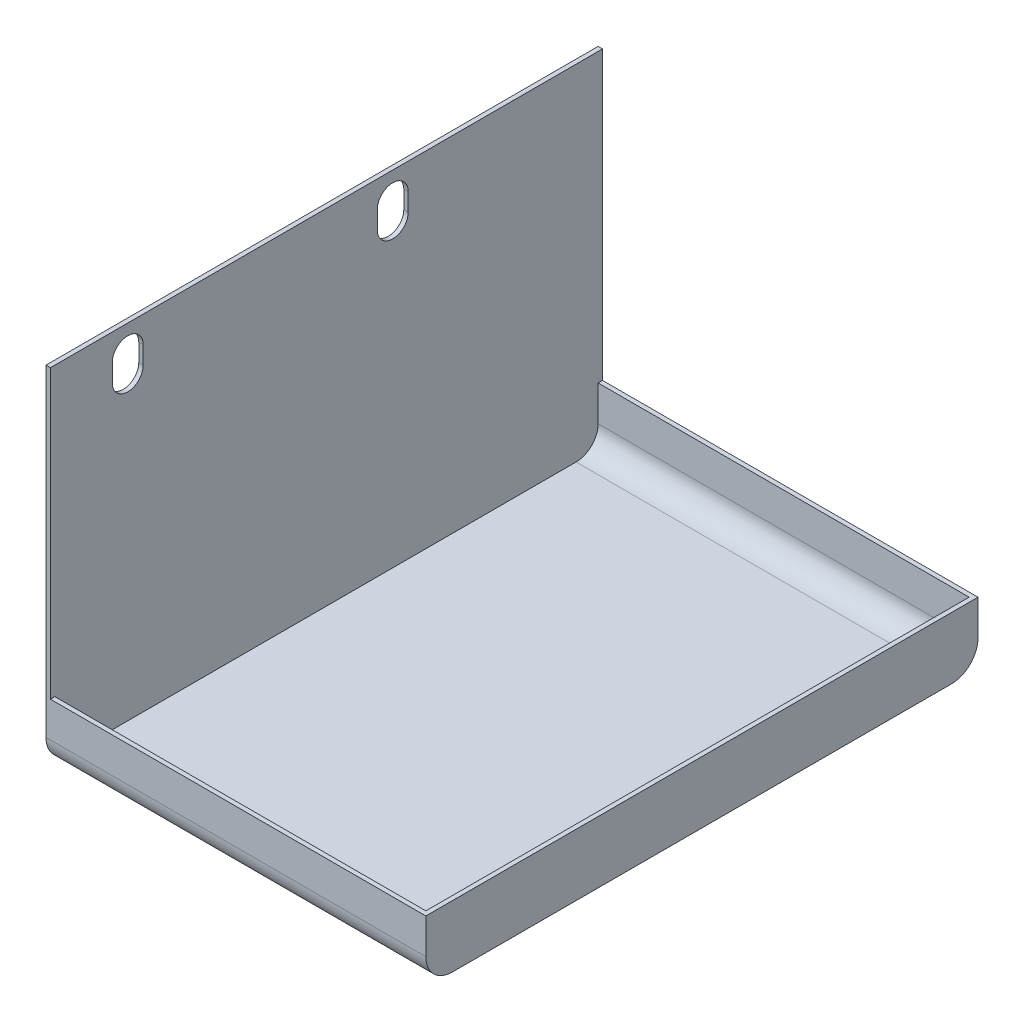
ISO-10303-21;
HEADER;
FILE_DESCRIPTION(('STEP AP214'),'2;1');
FILE_NAME('part.step','',(''),(''),'','','');
FILE_SCHEMA(('AUTOMOTIVE_DESIGN { 1 0 10303 214 1 1 1 1 }'));
ENDSEC;
DATA;
#1=APPLICATION_CONTEXT('core data for automotive mechanical design processes');
#2=APPLICATION_PROTOCOL_DEFINITION('international standard','automotive_design',2000,#1);
#3=PRODUCT_CONTEXT('',#1,'mechanical');
#4=PRODUCT('Part','Part','',(#3));
#5=PRODUCT_RELATED_PRODUCT_CATEGORY('part','',(#4));
#6=PRODUCT_DEFINITION_FORMATION('','',#4);
#7=PRODUCT_DEFINITION_CONTEXT('part definition',#1,'design');
#8=PRODUCT_DEFINITION('design','',#6,#7);
#9=PRODUCT_DEFINITION_SHAPE('','',#8);
#10=(LENGTH_UNIT() NAMED_UNIT(*) SI_UNIT(.MILLI.,.METRE.));
#11=(NAMED_UNIT(*) PLANE_ANGLE_UNIT() SI_UNIT($,.RADIAN.));
#12=(NAMED_UNIT(*) SI_UNIT($,.STERADIAN.) SOLID_ANGLE_UNIT());
#13=UNCERTAINTY_MEASURE_WITH_UNIT(LENGTH_MEASURE(1.E-05),#10,'distance_accuracy_value','');
#14=(GEOMETRIC_REPRESENTATION_CONTEXT(3) GLOBAL_UNCERTAINTY_ASSIGNED_CONTEXT((#13)) GLOBAL_UNIT_ASSIGNED_CONTEXT((#10,
#11,#12)) REPRESENTATION_CONTEXT('',''));
#15=CARTESIAN_POINT('',(0.,0.,0.));
#16=DIRECTION('',(0.,0.,1.));
#17=DIRECTION('',(1.,0.,0.));
#18=AXIS2_PLACEMENT_3D('',#15,#16,#17);
#19=CARTESIAN_POINT('',(0.,13.9999999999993,62.5));
#20=DIRECTION('',(0.,-1.,0.));
#21=DIRECTION('',(0.,0.,-1.));
#22=AXIS2_PLACEMENT_3D('',#19,#20,#21);
#23=PLANE('',#22);
#24=DIRECTION('',(0.,0.,-1.));
#25=VECTOR('',#24,1.);
#26=CARTESIAN_POINT('',(1.,13.9999999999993,62.5));
#27=LINE('',#26,#25);
#28=CARTESIAN_POINT('',(1.,13.9999999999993,62.5));
#29=VERTEX_POINT('',#28);
#30=CARTESIAN_POINT('',(1.00000000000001,14.,61.5));
#31=VERTEX_POINT('',#30);
#32=EDGE_CURVE('E236',#29,#31,#27,.T.);
#33=ORIENTED_EDGE('',*,*,#32,.F.);
#34=DIRECTION('',(-1.,0.,0.));
#35=VECTOR('',#34,1.);
#36=CARTESIAN_POINT('',(0.,13.9999999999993,62.5));
#37=LINE('',#36,#35);
#38=CARTESIAN_POINT('',(86.,14.,62.5));
#39=VERTEX_POINT('',#38);
#40=EDGE_CURVE('E299',#39,#29,#37,.T.);
#41=ORIENTED_EDGE('',*,*,#40,.F.);
#42=DIRECTION('',(0.,0.,-1.));
#43=VECTOR('',#42,1.);
#44=CARTESIAN_POINT('',(86.,14.,62.5));
#45=LINE('',#44,#43);
#46=CARTESIAN_POINT('',(86.,14.,-62.5));
#47=VERTEX_POINT('',#46);
#48=EDGE_CURVE('E302',#39,#47,#45,.T.);
#49=ORIENTED_EDGE('',*,*,#48,.T.);
#50=DIRECTION('',(-1.,0.,0.));
#51=VECTOR('',#50,1.);
#52=CARTESIAN_POINT('',(0.,14.,-62.5));
#53=LINE('',#52,#51);
#54=CARTESIAN_POINT('',(0.999999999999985,14.,-62.5));
#55=VERTEX_POINT('',#54);
#56=EDGE_CURVE('E291',#47,#55,#53,.T.);
#57=ORIENTED_EDGE('',*,*,#56,.T.);
#58=CARTESIAN_POINT('',(1.00000000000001,14.,-61.5));
#59=VERTEX_POINT('',#58);
#60=EDGE_CURVE('E11',#59,#55,#27,.T.);
#61=ORIENTED_EDGE('',*,*,#60,.F.);
#62=DIRECTION('',(-1.,0.,0.));
#63=VECTOR('',#62,1.);
#64=CARTESIAN_POINT('',(0.,14.,-61.5));
#65=LINE('',#64,#63);
#66=CARTESIAN_POINT('',(85.0000000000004,14.,-61.5));
#67=VERTEX_POINT('',#66);
#68=EDGE_CURVE('E273',#67,#59,#65,.T.);
#69=ORIENTED_EDGE('',*,*,#68,.F.);
#70=DIRECTION('',(0.,0.,-1.));
#71=VECTOR('',#70,1.);
#72=CARTESIAN_POINT('',(85.,14.,62.5));
#73=LINE('',#72,#71);
#74=CARTESIAN_POINT('',(85.,14.,61.5));
#75=VERTEX_POINT('',#74);
#76=EDGE_CURVE('E267',#75,#67,#73,.T.);
#77=ORIENTED_EDGE('',*,*,#76,.F.);
#78=DIRECTION('',(-1.,0.,0.));
#79=VECTOR('',#78,1.);
#80=CARTESIAN_POINT('',(0.,14.,61.5));
#81=LINE('',#80,#79);
#82=EDGE_CURVE('E278',#75,#31,#81,.T.);
#83=ORIENTED_EDGE('',*,*,#82,.T.);
#84=EDGE_LOOP('',(#33,#41,#49,#57,#61,#69,#77,#83));
#85=FACE_BOUND('',#84,.T.);
#86=ADVANCED_FACE('F16',(#85),#23,.F.);
#87=CARTESIAN_POINT('',(0.,-6.93889390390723E-13,62.5));
#88=DIRECTION('',(1.,0.,0.));
#89=DIRECTION('',(0.,0.,-1.));
#90=AXIS2_PLACEMENT_3D('',#87,#88,#89);
#91=PLANE('',#90);
#92=DIRECTION('',(0.,1.,0.));
#93=VECTOR('',#92,1.);
#94=CARTESIAN_POINT('',(0.,0.,41.5));
#95=LINE('',#94,#93);
#96=CARTESIAN_POINT('',(0.,69.,41.5));
#97=VERTEX_POINT('',#96);
#98=CARTESIAN_POINT('',(0.,73.,41.5));
#99=VERTEX_POINT('',#98);
#100=EDGE_CURVE('E198',#97,#99,#95,.T.);
#101=ORIENTED_EDGE('',*,*,#100,.T.);
#102=CARTESIAN_POINT('',(0.,73.,45.));
#103=DIRECTION('',(1.,0.,0.));
#104=DIRECTION('',(0.,0.,-1.));
#105=AXIS2_PLACEMENT_3D('',#102,#103,#104);
#106=CIRCLE('',#105,3.5);
#107=CARTESIAN_POINT('',(0.,73.,48.5));
#108=VERTEX_POINT('',#107);
#109=EDGE_CURVE('E201',#99,#108,#106,.T.);
#110=ORIENTED_EDGE('',*,*,#109,.T.);
#111=DIRECTION('',(0.,-1.,0.));
#112=VECTOR('',#111,1.);
#113=CARTESIAN_POINT('',(0.,0.,48.5));
#114=LINE('',#113,#112);
#115=CARTESIAN_POINT('',(0.,69.,48.5));
#116=VERTEX_POINT('',#115);
#117=EDGE_CURVE('E193',#108,#116,#114,.T.);
#118=ORIENTED_EDGE('',*,*,#117,.T.);
#119=CARTESIAN_POINT('',(0.,69.,45.));
#120=DIRECTION('',(1.,0.,0.));
#121=DIRECTION('',(0.,0.,-1.));
#122=AXIS2_PLACEMENT_3D('',#119,#120,#121);
#123=CIRCLE('',#122,3.5);
#124=EDGE_CURVE('E173',#116,#97,#123,.T.);
#125=ORIENTED_EDGE('',*,*,#124,.T.);
#126=EDGE_LOOP('',(#101,#110,#118,#125));
#127=FACE_BOUND('',#126,.T.);
#128=DIRECTION('',(0.,1.,0.));
#129=VECTOR('',#128,1.);
#130=CARTESIAN_POINT('',(0.,0.,-18.5));
#131=LINE('',#130,#129);
#132=CARTESIAN_POINT('',(0.,69.,-18.5));
#133=VERTEX_POINT('',#132);
#134=CARTESIAN_POINT('',(0.,73.,-18.5));
#135=VERTEX_POINT('',#134);
#136=EDGE_CURVE('E230',#133,#135,#131,.T.);
#137=ORIENTED_EDGE('',*,*,#136,.T.);
#138=CARTESIAN_POINT('',(0.,73.,-15.));
#139=DIRECTION('',(1.,0.,0.));
#140=DIRECTION('',(0.,0.,-1.));
#141=AXIS2_PLACEMENT_3D('',#138,#139,#140);
#142=CIRCLE('',#141,3.5);
#143=CARTESIAN_POINT('',(0.,73.,-11.5));
#144=VERTEX_POINT('',#143);
#145=EDGE_CURVE('E233',#135,#144,#142,.T.);
#146=ORIENTED_EDGE('',*,*,#145,.T.);
#147=DIRECTION('',(0.,-1.,0.));
#148=VECTOR('',#147,1.);
#149=CARTESIAN_POINT('',(0.,0.,-11.5));
#150=LINE('',#149,#148);
#151=CARTESIAN_POINT('',(0.,69.,-11.5));
#152=VERTEX_POINT('',#151);
#153=EDGE_CURVE('E218',#144,#152,#150,.T.);
#154=ORIENTED_EDGE('',*,*,#153,.T.);
#155=CARTESIAN_POINT('',(0.,69.,-15.));
#156=DIRECTION('',(1.,0.,0.));
#157=DIRECTION('',(0.,0.,-1.));
#158=AXIS2_PLACEMENT_3D('',#155,#156,#157);
#159=CIRCLE('',#158,3.5);
#160=EDGE_CURVE('E227',#152,#133,#159,.T.);
#161=ORIENTED_EDGE('',*,*,#160,.T.);
#162=EDGE_LOOP('',(#137,#146,#154,#161));
#163=FACE_BOUND('',#162,.T.);
#164=DIRECTION('',(0.,-1.,0.));
#165=VECTOR('',#164,1.);
#166=CARTESIAN_POINT('',(0.,0.,-62.5000000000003));
#167=LINE('',#166,#165);
#168=CARTESIAN_POINT('',(0.,78.9999999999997,-62.5));
#169=VERTEX_POINT('',#168);
#170=CARTESIAN_POINT('',(0.,6.00000000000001,-62.5));
#171=VERTEX_POINT('',#170);
#172=EDGE_CURVE('E283',#169,#171,#167,.T.);
#173=ORIENTED_EDGE('',*,*,#172,.T.);
#174=CARTESIAN_POINT('',(0.,6.00000000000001,-56.5));
#175=DIRECTION('',(1.,0.,0.));
#176=DIRECTION('',(0.,0.,-1.));
#177=AXIS2_PLACEMENT_3D('',#174,#175,#176);
#178=CIRCLE('',#177,6.);
#179=CARTESIAN_POINT('',(0.,0.,-56.5000000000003));
#180=VERTEX_POINT('',#179);
#181=EDGE_CURVE('E326',#171,#180,#178,.F.);
#182=ORIENTED_EDGE('',*,*,#181,.T.);
#183=DIRECTION('',(0.,0.,-1.));
#184=VECTOR('',#183,1.);
#185=CARTESIAN_POINT('',(0.,-6.93889390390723E-13,62.5));
#186=LINE('',#185,#184);
#187=CARTESIAN_POINT('',(0.,-6.93889390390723E-13,56.5));
#188=VERTEX_POINT('',#187);
#189=EDGE_CURVE('E311',#188,#180,#186,.T.);
#190=ORIENTED_EDGE('',*,*,#189,.F.);
#191=CARTESIAN_POINT('',(0.,5.99999999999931,56.5));
#192=DIRECTION('',(1.,0.,0.));
#193=DIRECTION('',(0.,0.,-1.));
#194=AXIS2_PLACEMENT_3D('',#191,#192,#193);
#195=CIRCLE('',#194,6.);
#196=CARTESIAN_POINT('',(0.,5.99999999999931,62.5));
#197=VERTEX_POINT('',#196);
#198=EDGE_CURVE('E325',#188,#197,#195,.F.);
#199=ORIENTED_EDGE('',*,*,#198,.T.);
#200=DIRECTION('',(0.,-1.,0.));
#201=VECTOR('',#200,1.);
#202=CARTESIAN_POINT('',(0.,-6.93889390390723E-13,62.5));
#203=LINE('',#202,#201);
#204=CARTESIAN_POINT('',(0.,79.,62.5));
#205=VERTEX_POINT('',#204);
#206=EDGE_CURVE('E294',#205,#197,#203,.T.);
#207=ORIENTED_EDGE('',*,*,#206,.F.);
#208=DIRECTION('',(0.,0.,1.));
#209=VECTOR('',#208,1.);
#210=CARTESIAN_POINT('',(0.,79.,62.5));
#211=LINE('',#210,#209);
#212=EDGE_CURVE('E359',#169,#205,#211,.T.);
#213=ORIENTED_EDGE('',*,*,#212,.F.);
#214=EDGE_LOOP('',(#173,#182,#190,#199,#207,#213));
#215=FACE_BOUND('',#214,.T.);
#216=ADVANCED_FACE('F18',(#127,#163,#215),#91,.F.);
#217=CARTESIAN_POINT('',(0.,-6.93889390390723E-13,62.5));
#218=DIRECTION('',(0.,1.,0.));
#219=DIRECTION('',(0.,0.,1.));
#220=AXIS2_PLACEMENT_3D('',#217,#218,#219);
#221=PLANE('',#220);
#222=ORIENTED_EDGE('',*,*,#189,.T.);
#223=DIRECTION('',(1.,0.,0.));
#224=VECTOR('',#223,1.);
#225=CARTESIAN_POINT('',(86.0000000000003,0.,-56.5000000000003));
#226=LINE('',#225,#224);
#227=CARTESIAN_POINT('',(86.0000000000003,0.,-56.5000000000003));
#228=VERTEX_POINT('',#227);
#229=EDGE_CURVE('E316',#180,#228,#226,.T.);
#230=ORIENTED_EDGE('',*,*,#229,.T.);
#231=DIRECTION('',(0.,0.,-1.));
#232=VECTOR('',#231,1.);
#233=CARTESIAN_POINT('',(86.,0.,62.5));
#234=LINE('',#233,#232);
#235=CARTESIAN_POINT('',(86.,0.,56.5));
#236=VERTEX_POINT('',#235);
#237=EDGE_CURVE('E308',#236,#228,#234,.T.);
#238=ORIENTED_EDGE('',*,*,#237,.F.);
#239=DIRECTION('',(1.,0.,0.));
#240=VECTOR('',#239,1.);
#241=CARTESIAN_POINT('',(0.,-6.93889390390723E-13,56.5));
#242=LINE('',#241,#240);
#243=EDGE_CURVE('E314',#236,#188,#242,.F.);
#244=ORIENTED_EDGE('',*,*,#243,.T.);
#245=EDGE_LOOP('',(#222,#230,#238,#244));
#246=FACE_BOUND('',#245,.T.);
#247=ADVANCED_FACE('F415',(#246),#221,.F.);
#248=CARTESIAN_POINT('',(86.,0.,62.5));
#249=DIRECTION('',(-1.,0.,0.));
#250=DIRECTION('',(0.,0.,1.));
#251=AXIS2_PLACEMENT_3D('',#248,#249,#250);
#252=PLANE('',#251);
#253=ORIENTED_EDGE('',*,*,#237,.T.);
#254=CARTESIAN_POINT('',(86.0000000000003,6.00000000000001,-56.5));
#255=DIRECTION('',(-1.,0.,0.));
#256=DIRECTION('',(0.,0.,1.));
#257=AXIS2_PLACEMENT_3D('',#254,#255,#256);
#258=CIRCLE('',#257,6.);
#259=CARTESIAN_POINT('',(86.0000000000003,6.00000000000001,-62.5));
#260=VERTEX_POINT('',#259);
#261=EDGE_CURVE('E321',#228,#260,#258,.F.);
#262=ORIENTED_EDGE('',*,*,#261,.T.);
#263=DIRECTION('',(0.,1.,0.));
#264=VECTOR('',#263,1.);
#265=CARTESIAN_POINT('',(86.0000000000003,0.,-62.5000000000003));
#266=LINE('',#265,#264);
#267=EDGE_CURVE('E289',#260,#47,#266,.T.);
#268=ORIENTED_EDGE('',*,*,#267,.T.);
#269=ORIENTED_EDGE('',*,*,#48,.F.);
#270=DIRECTION('',(0.,1.,0.));
#271=VECTOR('',#270,1.);
#272=CARTESIAN_POINT('',(86.,0.,62.5));
#273=LINE('',#272,#271);
#274=CARTESIAN_POINT('',(86.,5.99999999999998,62.5));
#275=VERTEX_POINT('',#274);
#276=EDGE_CURVE('E303',#275,#39,#273,.T.);
#277=ORIENTED_EDGE('',*,*,#276,.F.);
#278=CARTESIAN_POINT('',(86.,5.99999999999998,56.5));
#279=DIRECTION('',(-1.,0.,0.));
#280=DIRECTION('',(0.,0.,1.));
#281=AXIS2_PLACEMENT_3D('',#278,#279,#280);
#282=CIRCLE('',#281,6.);
#283=EDGE_CURVE('E319',#275,#236,#282,.F.);
#284=ORIENTED_EDGE('',*,*,#283,.T.);
#285=EDGE_LOOP('',(#253,#262,#268,#269,#277,#284));
#286=FACE_BOUND('',#285,.T.);
#287=ADVANCED_FACE('F341',(#286),#252,.F.);
#288=CARTESIAN_POINT('',(0.,13.9999999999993,62.5));
#289=DIRECTION('',(0.,0.,-1.));
#290=DIRECTION('',(-1.,0.,0.));
#291=AXIS2_PLACEMENT_3D('',#288,#289,#290);
#292=PLANE('',#291);
#293=ORIENTED_EDGE('',*,*,#206,.T.);
#294=DIRECTION('',(1.,0.,0.));
#295=VECTOR('',#294,1.);
#296=CARTESIAN_POINT('',(0.,5.99999999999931,62.5));
#297=LINE('',#296,#295);
#298=EDGE_CURVE('E25',#197,#275,#297,.T.);
#299=ORIENTED_EDGE('',*,*,#298,.T.);
#300=ORIENTED_EDGE('',*,*,#276,.T.);
#301=ORIENTED_EDGE('',*,*,#40,.T.);
#302=DIRECTION('',(0.,-1.,0.));
#303=VECTOR('',#302,1.);
#304=CARTESIAN_POINT('',(1.,79.,62.5000000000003));
#305=LINE('',#304,#303);
#306=CARTESIAN_POINT('',(1.,79.,62.5000000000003));
#307=VERTEX_POINT('',#306);
#308=EDGE_CURVE('E350',#307,#29,#305,.T.);
#309=ORIENTED_EDGE('',*,*,#308,.F.);
#310=DIRECTION('',(1.,0.,0.));
#311=VECTOR('',#310,1.);
#312=CARTESIAN_POINT('',(1.,79.,62.5000000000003));
#313=LINE('',#312,#311);
#314=EDGE_CURVE('E248',#205,#307,#313,.T.);
#315=ORIENTED_EDGE('',*,*,#314,.F.);
#316=EDGE_LOOP('',(#293,#299,#300,#301,#309,#315));
#317=FACE_BOUND('',#316,.T.);
#318=ADVANCED_FACE('F335',(#317),#292,.F.);
#319=CARTESIAN_POINT('',(0.,14.,-62.5));
#320=DIRECTION('',(0.,0.,-1.));
#321=DIRECTION('',(-1.,0.,0.));
#322=AXIS2_PLACEMENT_3D('',#319,#320,#321);
#323=PLANE('',#322);
#324=ORIENTED_EDGE('',*,*,#267,.F.);
#325=DIRECTION('',(1.,0.,0.));
#326=VECTOR('',#325,1.);
#327=CARTESIAN_POINT('',(0.,6.00000000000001,-62.5));
#328=LINE('',#327,#326);
#329=EDGE_CURVE('E323',#260,#171,#328,.F.);
#330=ORIENTED_EDGE('',*,*,#329,.T.);
#331=ORIENTED_EDGE('',*,*,#172,.F.);
#332=DIRECTION('',(-1.,0.,0.));
#333=VECTOR('',#332,1.);
#334=CARTESIAN_POINT('',(0.999999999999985,78.9999999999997,-62.5000000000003));
#335=LINE('',#334,#333);
#336=CARTESIAN_POINT('',(0.999999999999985,78.9999999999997,-62.5000000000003));
#337=VERTEX_POINT('',#336);
#338=EDGE_CURVE('E433',#337,#169,#335,.T.);
#339=ORIENTED_EDGE('',*,*,#338,.F.);
#340=DIRECTION('',(0.,-1.,0.));
#341=VECTOR('',#340,1.);
#342=CARTESIAN_POINT('',(0.999999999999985,78.9999999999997,-62.5000000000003));
#343=LINE('',#342,#341);
#344=EDGE_CURVE('E357',#337,#55,#343,.T.);
#345=ORIENTED_EDGE('',*,*,#344,.T.);
#346=ORIENTED_EDGE('',*,*,#56,.F.);
#347=EDGE_LOOP('',(#324,#330,#331,#339,#345,#346));
#348=FACE_BOUND('',#347,.T.);
#349=ADVANCED_FACE('F431',(#348),#323,.T.);
#350=CARTESIAN_POINT('',(0.,6.00000000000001,-56.5));
#351=DIRECTION('',(-1.,0.,0.));
#352=DIRECTION('',(0.,0.,1.));
#353=AXIS2_PLACEMENT_3D('',#350,#351,#352);
#354=CYLINDRICAL_SURFACE('',#353,6.);
#355=ORIENTED_EDGE('',*,*,#181,.F.);
#356=ORIENTED_EDGE('',*,*,#329,.F.);
#357=ORIENTED_EDGE('',*,*,#261,.F.);
#358=ORIENTED_EDGE('',*,*,#229,.F.);
#359=EDGE_LOOP('',(#355,#356,#357,#358));
#360=FACE_BOUND('',#359,.T.);
#361=ADVANCED_FACE('F428',(#360),#354,.T.);
#362=CARTESIAN_POINT('',(0.,5.99999999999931,56.5));
#363=DIRECTION('',(1.,0.,0.));
#364=DIRECTION('',(0.,0.,-1.));
#365=AXIS2_PLACEMENT_3D('',#362,#363,#364);
#366=CYLINDRICAL_SURFACE('',#365,6.);
#367=ORIENTED_EDGE('',*,*,#198,.F.);
#368=ORIENTED_EDGE('',*,*,#243,.F.);
#369=ORIENTED_EDGE('',*,*,#283,.F.);
#370=ORIENTED_EDGE('',*,*,#298,.F.);
#371=EDGE_LOOP('',(#367,#368,#369,#370));
#372=FACE_BOUND('',#371,.T.);
#373=ADVANCED_FACE('F408',(#372),#366,.T.);
#374=CARTESIAN_POINT('',(1.00000000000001,-6.93889390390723E-13,62.5));
#375=DIRECTION('',(1.,0.,0.));
#376=DIRECTION('',(0.,0.,-1.));
#377=AXIS2_PLACEMENT_3D('',#374,#375,#376);
#378=PLANE('',#377);
#379=CARTESIAN_POINT('',(1.00000000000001,73.,44.9999999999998));
#380=DIRECTION('',(1.,0.,0.));
#381=DIRECTION('',(0.,0.,-1.));
#382=AXIS2_PLACEMENT_3D('',#379,#380,#381);
#383=CIRCLE('',#382,3.5);
#384=CARTESIAN_POINT('',(1.00000000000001,73.,41.4999999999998));
#385=VERTEX_POINT('',#384);
#386=CARTESIAN_POINT('',(1.,73.,48.4999999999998));
#387=VERTEX_POINT('',#386);
#388=EDGE_CURVE('E41',#385,#387,#383,.T.);
#389=ORIENTED_EDGE('',*,*,#388,.F.);
#390=DIRECTION('',(0.,1.,0.));
#391=VECTOR('',#390,1.);
#392=CARTESIAN_POINT('',(1.00000000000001,73.,41.4999999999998));
#393=LINE('',#392,#391);
#394=CARTESIAN_POINT('',(1.00000000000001,69.,41.5));
#395=VERTEX_POINT('',#394);
#396=EDGE_CURVE('E186',#395,#385,#393,.T.);
#397=ORIENTED_EDGE('',*,*,#396,.F.);
#398=CARTESIAN_POINT('',(1.,69.,45.));
#399=DIRECTION('',(1.,0.,0.));
#400=DIRECTION('',(0.,0.,-1.));
#401=AXIS2_PLACEMENT_3D('',#398,#399,#400);
#402=CIRCLE('',#401,3.5);
#403=CARTESIAN_POINT('',(1.,69.,48.5));
#404=VERTEX_POINT('',#403);
#405=EDGE_CURVE('E170',#404,#395,#402,.T.);
#406=ORIENTED_EDGE('',*,*,#405,.F.);
#407=DIRECTION('',(0.,-1.,0.));
#408=VECTOR('',#407,1.);
#409=CARTESIAN_POINT('',(1.,73.,48.4999999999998));
#410=LINE('',#409,#408);
#411=EDGE_CURVE('E179',#387,#404,#410,.T.);
#412=ORIENTED_EDGE('',*,*,#411,.F.);
#413=EDGE_LOOP('',(#389,#397,#406,#412));
#414=FACE_BOUND('',#413,.T.);
#415=CARTESIAN_POINT('',(1.,73.,-14.9999999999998));
#416=DIRECTION('',(1.,0.,0.));
#417=DIRECTION('',(0.,0.,-1.));
#418=AXIS2_PLACEMENT_3D('',#415,#416,#417);
#419=CIRCLE('',#418,3.5);
#420=CARTESIAN_POINT('',(1.00000000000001,73.,-18.4999999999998));
#421=VERTEX_POINT('',#420);
#422=CARTESIAN_POINT('',(1.00000000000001,73.,-11.4999999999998));
#423=VERTEX_POINT('',#422);
#424=EDGE_CURVE('E204',#421,#423,#419,.T.);
#425=ORIENTED_EDGE('',*,*,#424,.F.);
#426=DIRECTION('',(0.,1.,0.));
#427=VECTOR('',#426,1.);
#428=CARTESIAN_POINT('',(1.00000000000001,73.,-18.4999999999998));
#429=LINE('',#428,#427);
#430=CARTESIAN_POINT('',(1.,69.,-18.5));
#431=VERTEX_POINT('',#430);
#432=EDGE_CURVE('E212',#431,#421,#429,.T.);
#433=ORIENTED_EDGE('',*,*,#432,.F.);
#434=CARTESIAN_POINT('',(1.,69.,-15.));
#435=DIRECTION('',(1.,0.,0.));
#436=DIRECTION('',(0.,0.,-1.));
#437=AXIS2_PLACEMENT_3D('',#434,#435,#436);
#438=CIRCLE('',#437,3.5);
#439=CARTESIAN_POINT('',(1.00000000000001,69.,-11.5));
#440=VERTEX_POINT('',#439);
#441=EDGE_CURVE('E209',#440,#431,#438,.T.);
#442=ORIENTED_EDGE('',*,*,#441,.F.);
#443=DIRECTION('',(0.,-1.,0.));
#444=VECTOR('',#443,1.);
#445=CARTESIAN_POINT('',(1.00000000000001,73.,-11.4999999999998));
#446=LINE('',#445,#444);
#447=EDGE_CURVE('E206',#423,#440,#446,.T.);
#448=ORIENTED_EDGE('',*,*,#447,.F.);
#449=EDGE_LOOP('',(#425,#433,#442,#448));
#450=FACE_BOUND('',#449,.T.);
#451=DIRECTION('',(0.,-1.,0.));
#452=VECTOR('',#451,1.);
#453=CARTESIAN_POINT('',(1.00000000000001,14.,-61.5));
#454=LINE('',#453,#452);
#455=CARTESIAN_POINT('',(1.,6.00000000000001,-61.5));
#456=VERTEX_POINT('',#455);
#457=EDGE_CURVE('E274',#59,#456,#454,.T.);
#458=ORIENTED_EDGE('',*,*,#457,.F.);
#459=ORIENTED_EDGE('',*,*,#60,.T.);
#460=ORIENTED_EDGE('',*,*,#344,.F.);
#461=DIRECTION('',(0.,0.,-1.));
#462=VECTOR('',#461,1.);
#463=CARTESIAN_POINT('',(1.,79.,62.5000000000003));
#464=LINE('',#463,#462);
#465=EDGE_CURVE('E239',#307,#337,#464,.T.);
#466=ORIENTED_EDGE('',*,*,#465,.F.);
#467=ORIENTED_EDGE('',*,*,#308,.T.);
#468=ORIENTED_EDGE('',*,*,#32,.T.);
#469=DIRECTION('',(0.,-1.,0.));
#470=VECTOR('',#469,1.);
#471=CARTESIAN_POINT('',(1.00000000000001,14.,61.5));
#472=LINE('',#471,#470);
#473=CARTESIAN_POINT('',(1.,6.00000000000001,61.5));
#474=VERTEX_POINT('',#473);
#475=EDGE_CURVE('E279',#31,#474,#472,.T.);
#476=ORIENTED_EDGE('',*,*,#475,.T.);
#477=CARTESIAN_POINT('',(1.00000000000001,5.99999999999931,56.5));
#478=DIRECTION('',(1.,0.,0.));
#479=DIRECTION('',(0.,0.,-1.));
#480=AXIS2_PLACEMENT_3D('',#477,#478,#479);
#481=CIRCLE('',#480,5.);
#482=CARTESIAN_POINT('',(1.,0.999999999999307,56.5));
#483=VERTEX_POINT('',#482);
#484=EDGE_CURVE('E253',#483,#474,#481,.F.);
#485=ORIENTED_EDGE('',*,*,#484,.F.);
#486=DIRECTION('',(0.,0.,-1.));
#487=VECTOR('',#486,1.);
#488=CARTESIAN_POINT('',(1.,0.999999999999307,62.5));
#489=LINE('',#488,#487);
#490=CARTESIAN_POINT('',(1.00000000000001,1.,-56.5));
#491=VERTEX_POINT('',#490);
#492=EDGE_CURVE('E254',#483,#491,#489,.T.);
#493=ORIENTED_EDGE('',*,*,#492,.T.);
#494=CARTESIAN_POINT('',(1.00000000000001,6.00000000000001,-56.5));
#495=DIRECTION('',(1.,0.,0.));
#496=DIRECTION('',(0.,0.,-1.));
#497=AXIS2_PLACEMENT_3D('',#494,#495,#496);
#498=CIRCLE('',#497,5.);
#499=EDGE_CURVE('E250',#456,#491,#498,.F.);
#500=ORIENTED_EDGE('',*,*,#499,.F.);
#501=EDGE_LOOP('',(#458,#459,#460,#466,#467,#468,#476,#485,#493,#500));
#502=FACE_BOUND('',#501,.T.);
#503=ADVANCED_FACE('F183',(#414,#450,#502),#378,.T.);
#504=CARTESIAN_POINT('',(0.,0.999999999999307,62.5));
#505=DIRECTION('',(0.,1.,0.));
#506=DIRECTION('',(0.,0.,1.));
#507=AXIS2_PLACEMENT_3D('',#504,#505,#506);
#508=PLANE('',#507);
#509=ORIENTED_EDGE('',*,*,#492,.F.);
#510=DIRECTION('',(1.,0.,0.));
#511=VECTOR('',#510,1.);
#512=CARTESIAN_POINT('',(0.,0.999999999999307,56.5));
#513=LINE('',#512,#511);
#514=CARTESIAN_POINT('',(85.,1.,56.5));
#515=VERTEX_POINT('',#514);
#516=EDGE_CURVE('E257',#515,#483,#513,.F.);
#517=ORIENTED_EDGE('',*,*,#516,.F.);
#518=DIRECTION('',(0.,0.,-1.));
#519=VECTOR('',#518,1.);
#520=CARTESIAN_POINT('',(85.,1.,62.5));
#521=LINE('',#520,#519);
#522=CARTESIAN_POINT('',(85.0000000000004,1.,-56.5));
#523=VERTEX_POINT('',#522);
#524=EDGE_CURVE('E258',#515,#523,#521,.T.);
#525=ORIENTED_EDGE('',*,*,#524,.T.);
#526=DIRECTION('',(1.,0.,0.));
#527=VECTOR('',#526,1.);
#528=CARTESIAN_POINT('',(0.,1.,-56.5));
#529=LINE('',#528,#527);
#530=EDGE_CURVE('E261',#491,#523,#529,.T.);
#531=ORIENTED_EDGE('',*,*,#530,.F.);
#532=EDGE_LOOP('',(#509,#517,#525,#531));
#533=FACE_BOUND('',#532,.T.);
#534=ADVANCED_FACE('F399',(#533),#508,.T.);
#535=CARTESIAN_POINT('',(85.,0.,62.5));
#536=DIRECTION('',(-1.,0.,0.));
#537=DIRECTION('',(0.,0.,1.));
#538=AXIS2_PLACEMENT_3D('',#535,#536,#537);
#539=PLANE('',#538);
#540=ORIENTED_EDGE('',*,*,#524,.F.);
#541=CARTESIAN_POINT('',(85.,5.99999999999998,56.5));
#542=DIRECTION('',(-1.,0.,0.));
#543=DIRECTION('',(0.,0.,1.));
#544=AXIS2_PLACEMENT_3D('',#541,#542,#543);
#545=CIRCLE('',#544,5.);
#546=CARTESIAN_POINT('',(85.,6.00000000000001,61.5));
#547=VERTEX_POINT('',#546);
#548=EDGE_CURVE('E264',#547,#515,#545,.F.);
#549=ORIENTED_EDGE('',*,*,#548,.F.);
#550=DIRECTION('',(0.,1.,0.));
#551=VECTOR('',#550,1.);
#552=CARTESIAN_POINT('',(85.,14.,61.5));
#553=LINE('',#552,#551);
#554=EDGE_CURVE('E275',#547,#75,#553,.T.);
#555=ORIENTED_EDGE('',*,*,#554,.T.);
#556=ORIENTED_EDGE('',*,*,#76,.T.);
#557=DIRECTION('',(0.,1.,0.));
#558=VECTOR('',#557,1.);
#559=CARTESIAN_POINT('',(85.0000000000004,14.,-61.5));
#560=LINE('',#559,#558);
#561=CARTESIAN_POINT('',(85.,6.00000000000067,-61.5));
#562=VERTEX_POINT('',#561);
#563=EDGE_CURVE('E271',#562,#67,#560,.T.);
#564=ORIENTED_EDGE('',*,*,#563,.F.);
#565=CARTESIAN_POINT('',(85.0000000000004,6.00000000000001,-56.5));
#566=DIRECTION('',(-1.,0.,0.));
#567=DIRECTION('',(0.,0.,1.));
#568=AXIS2_PLACEMENT_3D('',#565,#566,#567);
#569=CIRCLE('',#568,5.);
#570=EDGE_CURVE('E269',#523,#562,#569,.F.);
#571=ORIENTED_EDGE('',*,*,#570,.F.);
#572=EDGE_LOOP('',(#540,#549,#555,#556,#564,#571));
#573=FACE_BOUND('',#572,.T.);
#574=ADVANCED_FACE('F390',(#573),#539,.T.);
#575=CARTESIAN_POINT('',(0.,14.,61.5));
#576=DIRECTION('',(0.,0.,-1.));
#577=DIRECTION('',(-1.,0.,0.));
#578=AXIS2_PLACEMENT_3D('',#575,#576,#577);
#579=PLANE('',#578);
#580=ORIENTED_EDGE('',*,*,#475,.F.);
#581=ORIENTED_EDGE('',*,*,#82,.F.);
#582=ORIENTED_EDGE('',*,*,#554,.F.);
#583=DIRECTION('',(-1.,0.,0.));
#584=VECTOR('',#583,1.);
#585=CARTESIAN_POINT('',(0.,6.00000000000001,61.5));
#586=LINE('',#585,#584);
#587=EDGE_CURVE('E252',#474,#547,#586,.F.);
#588=ORIENTED_EDGE('',*,*,#587,.F.);
#589=EDGE_LOOP('',(#580,#581,#582,#588));
#590=FACE_BOUND('',#589,.T.);
#591=ADVANCED_FACE('F393',(#590),#579,.T.);
#592=CARTESIAN_POINT('',(0.,14.,-61.5));
#593=DIRECTION('',(0.,0.,-1.));
#594=DIRECTION('',(-1.,0.,0.));
#595=AXIS2_PLACEMENT_3D('',#592,#593,#594);
#596=PLANE('',#595);
#597=ORIENTED_EDGE('',*,*,#563,.T.);
#598=ORIENTED_EDGE('',*,*,#68,.T.);
#599=ORIENTED_EDGE('',*,*,#457,.T.);
#600=DIRECTION('',(-1.,0.,0.));
#601=VECTOR('',#600,1.);
#602=CARTESIAN_POINT('',(0.,6.00000000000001,-61.5));
#603=LINE('',#602,#601);
#604=EDGE_CURVE('E260',#562,#456,#603,.T.);
#605=ORIENTED_EDGE('',*,*,#604,.F.);
#606=EDGE_LOOP('',(#597,#598,#599,#605));
#607=FACE_BOUND('',#606,.T.);
#608=ADVANCED_FACE('F378',(#607),#596,.F.);
#609=CARTESIAN_POINT('',(0.,6.00000000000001,-56.5));
#610=DIRECTION('',(-1.,0.,0.));
#611=DIRECTION('',(0.,0.,1.));
#612=AXIS2_PLACEMENT_3D('',#609,#610,#611);
#613=CYLINDRICAL_SURFACE('',#612,5.);
#614=ORIENTED_EDGE('',*,*,#499,.T.);
#615=ORIENTED_EDGE('',*,*,#530,.T.);
#616=ORIENTED_EDGE('',*,*,#570,.T.);
#617=ORIENTED_EDGE('',*,*,#604,.T.);
#618=EDGE_LOOP('',(#614,#615,#616,#617));
#619=FACE_BOUND('',#618,.T.);
#620=ADVANCED_FACE('F387',(#619),#613,.F.);
#621=CARTESIAN_POINT('',(0.,5.99999999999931,56.5));
#622=DIRECTION('',(1.,0.,0.));
#623=DIRECTION('',(0.,0.,-1.));
#624=AXIS2_PLACEMENT_3D('',#621,#622,#623);
#625=CYLINDRICAL_SURFACE('',#624,5.);
#626=ORIENTED_EDGE('',*,*,#484,.T.);
#627=ORIENTED_EDGE('',*,*,#587,.T.);
#628=ORIENTED_EDGE('',*,*,#548,.T.);
#629=ORIENTED_EDGE('',*,*,#516,.T.);
#630=EDGE_LOOP('',(#626,#627,#628,#629));
#631=FACE_BOUND('',#630,.T.);
#632=ADVANCED_FACE('F396',(#631),#625,.F.);
#633=CARTESIAN_POINT('',(0.999999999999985,78.9999999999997,-62.5000000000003));
#634=DIRECTION('',(0.,1.,0.));
#635=DIRECTION('',(0.,0.,1.));
#636=AXIS2_PLACEMENT_3D('',#633,#634,#635);
#637=PLANE('',#636);
#638=ORIENTED_EDGE('',*,*,#465,.T.);
#639=ORIENTED_EDGE('',*,*,#338,.T.);
#640=ORIENTED_EDGE('',*,*,#212,.T.);
#641=ORIENTED_EDGE('',*,*,#314,.T.);
#642=EDGE_LOOP('',(#638,#639,#640,#641));
#643=FACE_BOUND('',#642,.T.);
#644=ADVANCED_FACE('F437',(#643),#637,.T.);
#645=CARTESIAN_POINT('',(-39.0000000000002,73.,-14.9999999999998));
#646=DIRECTION('',(1.,0.,0.));
#647=DIRECTION('',(0.,0.,-1.));
#648=AXIS2_PLACEMENT_3D('',#645,#646,#647);
#649=CYLINDRICAL_SURFACE('',#648,3.5);
#650=DIRECTION('',(1.,0.,0.));
#651=VECTOR('',#650,1.);
#652=CARTESIAN_POINT('',(-39.,73.,-18.4999999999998));
#653=LINE('',#652,#651);
#654=EDGE_CURVE('E216',#135,#421,#653,.T.);
#655=ORIENTED_EDGE('',*,*,#654,.T.);
#656=ORIENTED_EDGE('',*,*,#424,.T.);
#657=DIRECTION('',(1.,0.,0.));
#658=VECTOR('',#657,1.);
#659=CARTESIAN_POINT('',(-39.,73.,-11.4999999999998));
#660=LINE('',#659,#658);
#661=EDGE_CURVE('E215',#144,#423,#660,.T.);
#662=ORIENTED_EDGE('',*,*,#661,.F.);
#663=ORIENTED_EDGE('',*,*,#145,.F.);
#664=EDGE_LOOP('',(#655,#656,#662,#663));
#665=FACE_BOUND('',#664,.T.);
#666=ADVANCED_FACE('F516',(#665),#649,.F.);
#667=CARTESIAN_POINT('',(-39.,73.,-18.4999999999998));
#668=DIRECTION('',(0.,0.,-1.));
#669=DIRECTION('',(-1.,0.,0.));
#670=AXIS2_PLACEMENT_3D('',#667,#668,#669);
#671=PLANE('',#670);
#672=DIRECTION('',(1.,0.,0.));
#673=VECTOR('',#672,1.);
#674=CARTESIAN_POINT('',(-39.,69.,-18.5));
#675=LINE('',#674,#673);
#676=EDGE_CURVE('E219',#133,#431,#675,.T.);
#677=ORIENTED_EDGE('',*,*,#676,.T.);
#678=ORIENTED_EDGE('',*,*,#432,.T.);
#679=ORIENTED_EDGE('',*,*,#654,.F.);
#680=ORIENTED_EDGE('',*,*,#136,.F.);
#681=EDGE_LOOP('',(#677,#678,#679,#680));
#682=FACE_BOUND('',#681,.T.);
#683=ADVANCED_FACE('F523',(#682),#671,.F.);
#684=CARTESIAN_POINT('',(-39.0000000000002,69.,-15.));
#685=DIRECTION('',(1.,0.,0.));
#686=DIRECTION('',(0.,0.,-1.));
#687=AXIS2_PLACEMENT_3D('',#684,#685,#686);
#688=CYLINDRICAL_SURFACE('',#687,3.5);
#689=DIRECTION('',(1.,0.,0.));
#690=VECTOR('',#689,1.);
#691=CARTESIAN_POINT('',(-39.,69.,-11.5));
#692=LINE('',#691,#690);
#693=EDGE_CURVE('E221',#152,#440,#692,.T.);
#694=ORIENTED_EDGE('',*,*,#693,.T.);
#695=ORIENTED_EDGE('',*,*,#441,.T.);
#696=ORIENTED_EDGE('',*,*,#676,.F.);
#697=ORIENTED_EDGE('',*,*,#160,.F.);
#698=EDGE_LOOP('',(#694,#695,#696,#697));
#699=FACE_BOUND('',#698,.T.);
#700=ADVANCED_FACE('F531',(#699),#688,.F.);
#701=CARTESIAN_POINT('',(-39.,73.,-11.4999999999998));
#702=DIRECTION('',(0.,0.,1.));
#703=DIRECTION('',(0.,-1.,0.));
#704=AXIS2_PLACEMENT_3D('',#701,#702,#703);
#705=PLANE('',#704);
#706=ORIENTED_EDGE('',*,*,#661,.T.);
#707=ORIENTED_EDGE('',*,*,#447,.T.);
#708=ORIENTED_EDGE('',*,*,#693,.F.);
#709=ORIENTED_EDGE('',*,*,#153,.F.);
#710=EDGE_LOOP('',(#706,#707,#708,#709));
#711=FACE_BOUND('',#710,.T.);
#712=ADVANCED_FACE('F539',(#711),#705,.F.);
#713=CARTESIAN_POINT('',(-39.,73.,44.9999999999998));
#714=DIRECTION('',(1.,0.,0.));
#715=DIRECTION('',(0.,0.,-1.));
#716=AXIS2_PLACEMENT_3D('',#713,#714,#715);
#717=CYLINDRICAL_SURFACE('',#716,3.5);
#718=DIRECTION('',(1.,0.,0.));
#719=VECTOR('',#718,1.);
#720=CARTESIAN_POINT('',(-39.,73.,41.4999999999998));
#721=LINE('',#720,#719);
#722=EDGE_CURVE('E191',#99,#385,#721,.T.);
#723=ORIENTED_EDGE('',*,*,#722,.T.);
#724=ORIENTED_EDGE('',*,*,#388,.T.);
#725=DIRECTION('',(1.,0.,0.));
#726=VECTOR('',#725,1.);
#727=CARTESIAN_POINT('',(-39.,73.,48.4999999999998));
#728=LINE('',#727,#726);
#729=EDGE_CURVE('E176',#108,#387,#728,.T.);
#730=ORIENTED_EDGE('',*,*,#729,.F.);
#731=ORIENTED_EDGE('',*,*,#109,.F.);
#732=EDGE_LOOP('',(#723,#724,#730,#731));
#733=FACE_BOUND('',#732,.T.);
#734=ADVANCED_FACE('F547',(#733),#717,.F.);
#735=CARTESIAN_POINT('',(-39.,73.,41.4999999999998));
#736=DIRECTION('',(0.,0.,-1.));
#737=DIRECTION('',(0.,1.,0.));
#738=AXIS2_PLACEMENT_3D('',#735,#736,#737);
#739=PLANE('',#738);
#740=DIRECTION('',(1.,0.,0.));
#741=VECTOR('',#740,1.);
#742=CARTESIAN_POINT('',(-39.,69.,41.5));
#743=LINE('',#742,#741);
#744=EDGE_CURVE('E175',#97,#395,#743,.T.);
#745=ORIENTED_EDGE('',*,*,#744,.T.);
#746=ORIENTED_EDGE('',*,*,#396,.T.);
#747=ORIENTED_EDGE('',*,*,#722,.F.);
#748=ORIENTED_EDGE('',*,*,#100,.F.);
#749=EDGE_LOOP('',(#745,#746,#747,#748));
#750=FACE_BOUND('',#749,.T.);
#751=ADVANCED_FACE('F555',(#750),#739,.F.);
#752=CARTESIAN_POINT('',(-39.,69.,45.));
#753=DIRECTION('',(1.,0.,0.));
#754=DIRECTION('',(0.,0.,-1.));
#755=AXIS2_PLACEMENT_3D('',#752,#753,#754);
#756=CYLINDRICAL_SURFACE('',#755,3.5);
#757=DIRECTION('',(1.,0.,0.));
#758=VECTOR('',#757,1.);
#759=CARTESIAN_POINT('',(-39.,69.,48.5));
#760=LINE('',#759,#758);
#761=EDGE_CURVE('E33',#116,#404,#760,.T.);
#762=ORIENTED_EDGE('',*,*,#761,.T.);
#763=ORIENTED_EDGE('',*,*,#405,.T.);
#764=ORIENTED_EDGE('',*,*,#744,.F.);
#765=ORIENTED_EDGE('',*,*,#124,.F.);
#766=EDGE_LOOP('',(#762,#763,#764,#765));
#767=FACE_BOUND('',#766,.T.);
#768=ADVANCED_FACE('F167',(#767),#756,.F.);
#769=CARTESIAN_POINT('',(-39.,73.,48.4999999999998));
#770=DIRECTION('',(0.,0.,1.));
#771=DIRECTION('',(1.,0.,0.));
#772=AXIS2_PLACEMENT_3D('',#769,#770,#771);
#773=PLANE('',#772);
#774=ORIENTED_EDGE('',*,*,#729,.T.);
#775=ORIENTED_EDGE('',*,*,#411,.T.);
#776=ORIENTED_EDGE('',*,*,#761,.F.);
#777=ORIENTED_EDGE('',*,*,#117,.F.);
#778=EDGE_LOOP('',(#774,#775,#776,#777));
#779=FACE_BOUND('',#778,.T.);
#780=ADVANCED_FACE('F180',(#779),#773,.F.);
#781=CLOSED_SHELL('',(#86,#216,#247,#287,#318,#349,#361,#373,#503,#534,#574,#591,#608,#620,#632,
#644,#666,#683,#700,#712,#734,#751,#768,#780));
#782=MANIFOLD_SOLID_BREP('B1',#781);
#783=ADVANCED_BREP_SHAPE_REPRESENTATION('',(#18,#782),#14);
#784=SHAPE_DEFINITION_REPRESENTATION(#9,#783);
ENDSEC;
END-ISO-10303-21;
